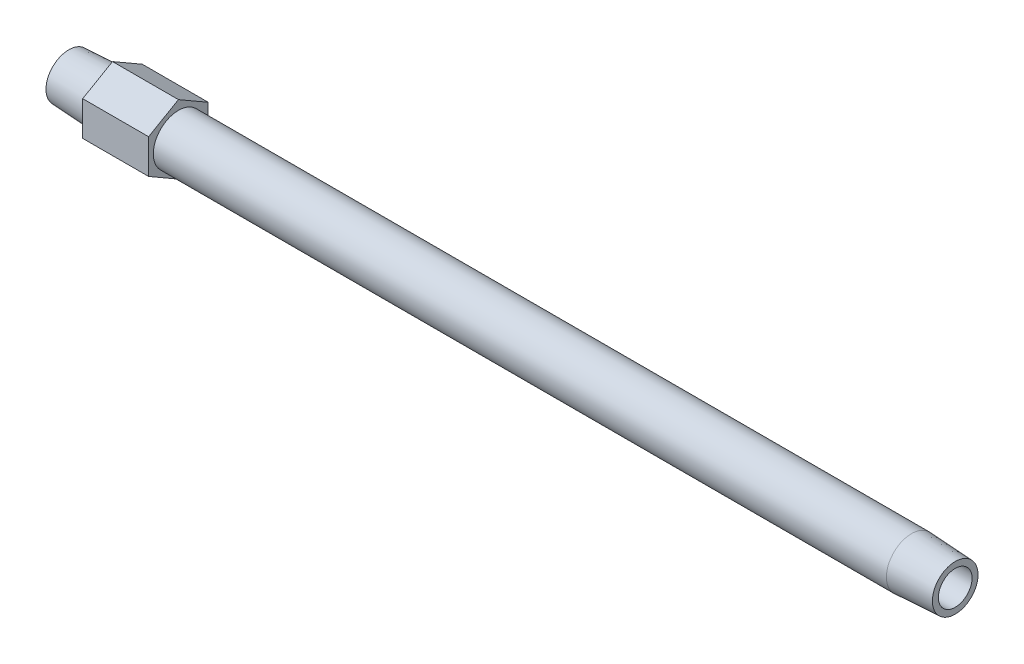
ISO-10303-21;
HEADER;
FILE_DESCRIPTION(('STEP AP214'),'2;1');
FILE_NAME('part.step','',(''),(''),'','','');
FILE_SCHEMA(('AUTOMOTIVE_DESIGN { 1 0 10303 214 1 1 1 1 }'));
ENDSEC;
DATA;
#1=APPLICATION_CONTEXT('core data for automotive mechanical design processes');
#2=APPLICATION_PROTOCOL_DEFINITION('international standard','automotive_design',2000,#1);
#3=PRODUCT_CONTEXT('',#1,'mechanical');
#4=PRODUCT('Part','Part','',(#3));
#5=PRODUCT_RELATED_PRODUCT_CATEGORY('part','',(#4));
#6=PRODUCT_DEFINITION_FORMATION('','',#4);
#7=PRODUCT_DEFINITION_CONTEXT('part definition',#1,'design');
#8=PRODUCT_DEFINITION('design','',#6,#7);
#9=PRODUCT_DEFINITION_SHAPE('','',#8);
#10=(LENGTH_UNIT() NAMED_UNIT(*) SI_UNIT(.MILLI.,.METRE.));
#11=(NAMED_UNIT(*) PLANE_ANGLE_UNIT() SI_UNIT($,.RADIAN.));
#12=(NAMED_UNIT(*) SI_UNIT($,.STERADIAN.) SOLID_ANGLE_UNIT());
#13=UNCERTAINTY_MEASURE_WITH_UNIT(LENGTH_MEASURE(1.E-05),#10,'distance_accuracy_value','');
#14=(GEOMETRIC_REPRESENTATION_CONTEXT(3) GLOBAL_UNCERTAINTY_ASSIGNED_CONTEXT((#13)) GLOBAL_UNIT_ASSIGNED_CONTEXT((#10,
#11,#12)) REPRESENTATION_CONTEXT('',''));
#15=CARTESIAN_POINT('',(0.,0.,0.));
#16=DIRECTION('',(0.,0.,1.));
#17=DIRECTION('',(1.,0.,0.));
#18=AXIS2_PLACEMENT_3D('',#15,#16,#17);
#19=CARTESIAN_POINT('',(0.,0.,-3.59899397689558));
#20=DIRECTION('',(1.,0.,0.));
#21=DIRECTION('',(0.,0.,-1.));
#22=AXIS2_PLACEMENT_3D('',#19,#20,#21);
#23=PLANE('',#22);
#24=CARTESIAN_POINT('',(0.,0.,0.));
#25=DIRECTION('',(-1.,0.,0.));
#26=DIRECTION('',(0.,0.,1.));
#27=AXIS2_PLACEMENT_3D('',#24,#25,#26);
#28=CIRCLE('',#27,3.59899397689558);
#29=CARTESIAN_POINT('',(0.,0.,3.59899397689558));
#30=VERTEX_POINT('',#29);
#31=EDGE_CURVE('E147',#30,#30,#28,.T.);
#32=ORIENTED_EDGE('',*,*,#31,.T.);
#33=EDGE_LOOP('',(#32));
#34=FACE_BOUND('',#33,.T.);
#35=CARTESIAN_POINT('',(0.,0.,0.));
#36=DIRECTION('',(1.,0.,0.));
#37=DIRECTION('',(0.,0.,1.));
#38=AXIS2_PLACEMENT_3D('',#35,#36,#37);
#39=CIRCLE('',#38,2.6543);
#40=CARTESIAN_POINT('',(0.,0.,2.6543));
#41=VERTEX_POINT('',#40);
#42=EDGE_CURVE('E159',#41,#41,#39,.T.);
#43=ORIENTED_EDGE('',*,*,#42,.T.);
#44=EDGE_LOOP('',(#43));
#45=FACE_BOUND('',#44,.T.);
#46=ADVANCED_FACE('F15',(#34,#45),#23,.F.);
#47=CARTESIAN_POINT('',(139.7,0.,-3.59899397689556));
#48=DIRECTION('',(-1.,0.,0.));
#49=DIRECTION('',(0.,0.,1.));
#50=AXIS2_PLACEMENT_3D('',#47,#48,#49);
#51=PLANE('',#50);
#52=CARTESIAN_POINT('',(139.7,0.,0.));
#53=DIRECTION('',(-1.,0.,0.));
#54=DIRECTION('',(0.,0.,1.));
#55=AXIS2_PLACEMENT_3D('',#52,#53,#54);
#56=CIRCLE('',#55,3.59899397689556);
#57=CARTESIAN_POINT('',(139.7,0.,3.59899397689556));
#58=VERTEX_POINT('',#57);
#59=EDGE_CURVE('E150',#58,#58,#56,.T.);
#60=ORIENTED_EDGE('',*,*,#59,.F.);
#61=EDGE_LOOP('',(#60));
#62=FACE_BOUND('',#61,.T.);
#63=CARTESIAN_POINT('',(139.7,0.,0.));
#64=DIRECTION('',(-1.,0.,0.));
#65=DIRECTION('',(0.,0.,1.));
#66=AXIS2_PLACEMENT_3D('',#63,#64,#65);
#67=CIRCLE('',#66,2.6543);
#68=CARTESIAN_POINT('',(139.7,0.,2.6543));
#69=VERTEX_POINT('',#68);
#70=EDGE_CURVE('E156',#69,#69,#67,.F.);
#71=ORIENTED_EDGE('',*,*,#70,.F.);
#72=EDGE_LOOP('',(#71));
#73=FACE_BOUND('',#72,.T.);
#74=ADVANCED_FACE('F178',(#62,#73),#51,.F.);
#75=CARTESIAN_POINT('',(17.272,-2.71296891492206,-4.699));
#76=DIRECTION('',(1.,0.,0.));
#77=DIRECTION('',(0.,1.,0.));
#78=AXIS2_PLACEMENT_3D('',#75,#76,#77);
#79=PLANE('',#78);
#80=DIRECTION('',(0.,0.5,-0.866025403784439));
#81=VECTOR('',#80,1.);
#82=CARTESIAN_POINT('',(17.272,-5.4259378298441,0.));
#83=LINE('',#82,#81);
#84=CARTESIAN_POINT('',(17.272,-5.4259378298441,0.));
#85=VERTEX_POINT('',#84);
#86=CARTESIAN_POINT('',(17.272,-2.71296891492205,-4.699));
#87=VERTEX_POINT('',#86);
#88=EDGE_CURVE('E103',#85,#87,#83,.T.);
#89=ORIENTED_EDGE('',*,*,#88,.T.);
#90=DIRECTION('',(0.,1.,0.));
#91=VECTOR('',#90,1.);
#92=CARTESIAN_POINT('',(17.272,-2.71296891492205,-4.699));
#93=LINE('',#92,#91);
#94=CARTESIAN_POINT('',(17.272,2.71296891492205,-4.699));
#95=VERTEX_POINT('',#94);
#96=EDGE_CURVE('E83',#87,#95,#93,.T.);
#97=ORIENTED_EDGE('',*,*,#96,.T.);
#98=DIRECTION('',(0.,0.5,0.866025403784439));
#99=VECTOR('',#98,1.);
#100=CARTESIAN_POINT('',(17.272,2.71296891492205,-4.699));
#101=LINE('',#100,#99);
#102=CARTESIAN_POINT('',(17.272,5.4259378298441,0.));
#103=VERTEX_POINT('',#102);
#104=EDGE_CURVE('E102',#95,#103,#101,.T.);
#105=ORIENTED_EDGE('',*,*,#104,.T.);
#106=DIRECTION('',(0.,-0.5,0.866025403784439));
#107=VECTOR('',#106,1.);
#108=CARTESIAN_POINT('',(17.272,5.4259378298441,0.));
#109=LINE('',#108,#107);
#110=CARTESIAN_POINT('',(17.272,2.71296891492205,4.699));
#111=VERTEX_POINT('',#110);
#112=EDGE_CURVE('E105',#103,#111,#109,.T.);
#113=ORIENTED_EDGE('',*,*,#112,.T.);
#114=DIRECTION('',(0.,-1.,0.));
#115=VECTOR('',#114,1.);
#116=CARTESIAN_POINT('',(17.272,2.71296891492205,4.699));
#117=LINE('',#116,#115);
#118=CARTESIAN_POINT('',(17.272,-2.71296891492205,4.699));
#119=VERTEX_POINT('',#118);
#120=EDGE_CURVE('E35',#111,#119,#117,.T.);
#121=ORIENTED_EDGE('',*,*,#120,.T.);
#122=DIRECTION('',(0.,-0.5,-0.866025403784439));
#123=VECTOR('',#122,1.);
#124=CARTESIAN_POINT('',(17.272,-2.71296891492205,4.699));
#125=LINE('',#124,#123);
#126=EDGE_CURVE('E30',#119,#85,#125,.T.);
#127=ORIENTED_EDGE('',*,*,#126,.T.);
#128=EDGE_LOOP('',(#89,#97,#105,#113,#121,#127));
#129=FACE_BOUND('',#128,.T.);
#130=CARTESIAN_POINT('',(17.272,0.,0.));
#131=DIRECTION('',(1.,0.,0.));
#132=DIRECTION('',(0.,1.,0.));
#133=AXIS2_PLACEMENT_3D('',#130,#131,#132);
#134=CIRCLE('',#133,3.95973768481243);
#135=CARTESIAN_POINT('',(17.272,3.95973768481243,0.));
#136=VERTEX_POINT('',#135);
#137=EDGE_CURVE('E89',#136,#136,#134,.F.);
#138=ORIENTED_EDGE('',*,*,#137,.T.);
#139=EDGE_LOOP('',(#138));
#140=FACE_BOUND('',#139,.T.);
#141=ADVANCED_FACE('F124',(#129,#140),#79,.T.);
#142=CARTESIAN_POINT('',(6.8834,-2.71296891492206,-4.699));
#143=DIRECTION('',(1.,0.,0.));
#144=DIRECTION('',(0.,1.,0.));
#145=AXIS2_PLACEMENT_3D('',#142,#143,#144);
#146=PLANE('',#145);
#147=DIRECTION('',(0.,0.5,-0.866025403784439));
#148=VECTOR('',#147,1.);
#149=CARTESIAN_POINT('',(6.8834,-5.4259378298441,0.));
#150=LINE('',#149,#148);
#151=CARTESIAN_POINT('',(6.8834,-5.4259378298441,0.));
#152=VERTEX_POINT('',#151);
#153=CARTESIAN_POINT('',(6.8834,-2.71296891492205,-4.699));
#154=VERTEX_POINT('',#153);
#155=EDGE_CURVE('E73',#152,#154,#150,.T.);
#156=ORIENTED_EDGE('',*,*,#155,.F.);
#157=DIRECTION('',(0.,-0.5,-0.866025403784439));
#158=VECTOR('',#157,1.);
#159=CARTESIAN_POINT('',(6.8834,-2.71296891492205,4.699));
#160=LINE('',#159,#158);
#161=CARTESIAN_POINT('',(6.8834,-2.71296891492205,4.699));
#162=VERTEX_POINT('',#161);
#163=EDGE_CURVE('E99',#162,#152,#160,.T.);
#164=ORIENTED_EDGE('',*,*,#163,.F.);
#165=DIRECTION('',(0.,-1.,0.));
#166=VECTOR('',#165,1.);
#167=CARTESIAN_POINT('',(6.8834,2.71296891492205,4.699));
#168=LINE('',#167,#166);
#169=CARTESIAN_POINT('',(6.8834,2.71296891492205,4.699));
#170=VERTEX_POINT('',#169);
#171=EDGE_CURVE('E133',#170,#162,#168,.T.);
#172=ORIENTED_EDGE('',*,*,#171,.F.);
#173=DIRECTION('',(0.,-0.5,0.866025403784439));
#174=VECTOR('',#173,1.);
#175=CARTESIAN_POINT('',(6.8834,5.4259378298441,0.));
#176=LINE('',#175,#174);
#177=CARTESIAN_POINT('',(6.8834,5.4259378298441,0.));
#178=VERTEX_POINT('',#177);
#179=EDGE_CURVE('E129',#178,#170,#176,.T.);
#180=ORIENTED_EDGE('',*,*,#179,.F.);
#181=DIRECTION('',(0.,0.5,0.866025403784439));
#182=VECTOR('',#181,1.);
#183=CARTESIAN_POINT('',(6.8834,2.71296891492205,-4.699));
#184=LINE('',#183,#182);
#185=CARTESIAN_POINT('',(6.8834,2.71296891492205,-4.699));
#186=VERTEX_POINT('',#185);
#187=EDGE_CURVE('E75',#186,#178,#184,.T.);
#188=ORIENTED_EDGE('',*,*,#187,.F.);
#189=DIRECTION('',(0.,1.,0.));
#190=VECTOR('',#189,1.);
#191=CARTESIAN_POINT('',(6.8834,-2.71296891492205,-4.699));
#192=LINE('',#191,#190);
#193=EDGE_CURVE('E68',#154,#186,#192,.T.);
#194=ORIENTED_EDGE('',*,*,#193,.F.);
#195=EDGE_LOOP('',(#156,#164,#172,#180,#188,#194));
#196=FACE_BOUND('',#195,.T.);
#197=CARTESIAN_POINT('',(6.8834,0.,0.));
#198=DIRECTION('',(-1.,0.,0.));
#199=DIRECTION('',(0.,0.,1.));
#200=AXIS2_PLACEMENT_3D('',#197,#198,#199);
#201=CIRCLE('',#200,3.95973768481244);
#202=CARTESIAN_POINT('',(6.8834,0.,3.95973768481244));
#203=VERTEX_POINT('',#202);
#204=EDGE_CURVE('E95',#203,#203,#201,.T.);
#205=ORIENTED_EDGE('',*,*,#204,.F.);
#206=EDGE_LOOP('',(#205));
#207=FACE_BOUND('',#206,.T.);
#208=ADVANCED_FACE('F69',(#196,#207),#146,.F.);
#209=CARTESIAN_POINT('',(17.272,-5.4259378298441,0.));
#210=DIRECTION('',(0.,0.866025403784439,0.5));
#211=DIRECTION('',(0.,-0.5,0.866025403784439));
#212=AXIS2_PLACEMENT_3D('',#209,#210,#211);
#213=PLANE('',#212);
#214=ORIENTED_EDGE('',*,*,#155,.T.);
#215=DIRECTION('',(-1.,0.,0.));
#216=VECTOR('',#215,1.);
#217=CARTESIAN_POINT('',(17.272,-2.71296891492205,-4.699));
#218=LINE('',#217,#216);
#219=EDGE_CURVE('E10',#87,#154,#218,.T.);
#220=ORIENTED_EDGE('',*,*,#219,.F.);
#221=ORIENTED_EDGE('',*,*,#88,.F.);
#222=DIRECTION('',(-1.,0.,0.));
#223=VECTOR('',#222,1.);
#224=CARTESIAN_POINT('',(17.272,-5.4259378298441,0.));
#225=LINE('',#224,#223);
#226=EDGE_CURVE('E87',#85,#152,#225,.T.);
#227=ORIENTED_EDGE('',*,*,#226,.T.);
#228=EDGE_LOOP('',(#214,#220,#221,#227));
#229=FACE_BOUND('',#228,.T.);
#230=ADVANCED_FACE('F17',(#229),#213,.F.);
#231=CARTESIAN_POINT('',(17.272,-2.71296891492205,-4.699));
#232=DIRECTION('',(0.,0.,1.));
#233=DIRECTION('',(1.,0.,0.));
#234=AXIS2_PLACEMENT_3D('',#231,#232,#233);
#235=PLANE('',#234);
#236=ORIENTED_EDGE('',*,*,#193,.T.);
#237=DIRECTION('',(-1.,0.,0.));
#238=VECTOR('',#237,1.);
#239=CARTESIAN_POINT('',(17.272,2.71296891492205,-4.699));
#240=LINE('',#239,#238);
#241=EDGE_CURVE('E23',#95,#186,#240,.T.);
#242=ORIENTED_EDGE('',*,*,#241,.F.);
#243=ORIENTED_EDGE('',*,*,#96,.F.);
#244=ORIENTED_EDGE('',*,*,#219,.T.);
#245=EDGE_LOOP('',(#236,#242,#243,#244));
#246=FACE_BOUND('',#245,.T.);
#247=ADVANCED_FACE('F82',(#246),#235,.F.);
#248=CARTESIAN_POINT('',(17.272,2.71296891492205,-4.699));
#249=DIRECTION('',(0.,-0.866025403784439,0.5));
#250=DIRECTION('',(0.,-0.5,-0.866025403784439));
#251=AXIS2_PLACEMENT_3D('',#248,#249,#250);
#252=PLANE('',#251);
#253=ORIENTED_EDGE('',*,*,#187,.T.);
#254=DIRECTION('',(-1.,0.,0.));
#255=VECTOR('',#254,1.);
#256=CARTESIAN_POINT('',(17.272,5.4259378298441,0.));
#257=LINE('',#256,#255);
#258=EDGE_CURVE('E117',#103,#178,#257,.T.);
#259=ORIENTED_EDGE('',*,*,#258,.F.);
#260=ORIENTED_EDGE('',*,*,#104,.F.);
#261=ORIENTED_EDGE('',*,*,#241,.T.);
#262=EDGE_LOOP('',(#253,#259,#260,#261));
#263=FACE_BOUND('',#262,.T.);
#264=ADVANCED_FACE('F121',(#263),#252,.F.);
#265=CARTESIAN_POINT('',(17.272,5.4259378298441,0.));
#266=DIRECTION('',(0.,-0.866025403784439,-0.5));
#267=DIRECTION('',(0.,0.5,-0.866025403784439));
#268=AXIS2_PLACEMENT_3D('',#265,#266,#267);
#269=PLANE('',#268);
#270=ORIENTED_EDGE('',*,*,#179,.T.);
#271=DIRECTION('',(-1.,0.,0.));
#272=VECTOR('',#271,1.);
#273=CARTESIAN_POINT('',(17.272,2.71296891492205,4.699));
#274=LINE('',#273,#272);
#275=EDGE_CURVE('E114',#111,#170,#274,.T.);
#276=ORIENTED_EDGE('',*,*,#275,.F.);
#277=ORIENTED_EDGE('',*,*,#112,.F.);
#278=ORIENTED_EDGE('',*,*,#258,.T.);
#279=EDGE_LOOP('',(#270,#276,#277,#278));
#280=FACE_BOUND('',#279,.T.);
#281=ADVANCED_FACE('F128',(#280),#269,.F.);
#282=CARTESIAN_POINT('',(17.272,2.71296891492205,4.699));
#283=DIRECTION('',(0.,0.,-1.));
#284=DIRECTION('',(-1.,0.,0.));
#285=AXIS2_PLACEMENT_3D('',#282,#283,#284);
#286=PLANE('',#285);
#287=ORIENTED_EDGE('',*,*,#171,.T.);
#288=DIRECTION('',(-1.,0.,0.));
#289=VECTOR('',#288,1.);
#290=CARTESIAN_POINT('',(17.272,-2.71296891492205,4.699));
#291=LINE('',#290,#289);
#292=EDGE_CURVE('E111',#119,#162,#291,.T.);
#293=ORIENTED_EDGE('',*,*,#292,.F.);
#294=ORIENTED_EDGE('',*,*,#120,.F.);
#295=ORIENTED_EDGE('',*,*,#275,.T.);
#296=EDGE_LOOP('',(#287,#293,#294,#295));
#297=FACE_BOUND('',#296,.T.);
#298=ADVANCED_FACE('F132',(#297),#286,.F.);
#299=CARTESIAN_POINT('',(17.272,-2.71296891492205,4.699));
#300=DIRECTION('',(0.,0.866025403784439,-0.5));
#301=DIRECTION('',(0.,0.5,0.866025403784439));
#302=AXIS2_PLACEMENT_3D('',#299,#300,#301);
#303=PLANE('',#302);
#304=ORIENTED_EDGE('',*,*,#163,.T.);
#305=ORIENTED_EDGE('',*,*,#226,.F.);
#306=ORIENTED_EDGE('',*,*,#126,.F.);
#307=ORIENTED_EDGE('',*,*,#292,.T.);
#308=EDGE_LOOP('',(#304,#305,#306,#307));
#309=FACE_BOUND('',#308,.T.);
#310=ADVANCED_FACE('F135',(#309),#303,.F.);
#311=CARTESIAN_POINT('',(6.8834,0.,0.));
#312=DIRECTION('',(1.,0.,0.));
#313=DIRECTION('',(0.,0.,-1.));
#314=AXIS2_PLACEMENT_3D('',#311,#312,#313);
#315=CONICAL_SURFACE('',#314,3.95973768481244,0.0523598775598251);
#316=ORIENTED_EDGE('',*,*,#31,.F.);
#317=EDGE_LOOP('',(#316));
#318=FACE_BOUND('',#317,.T.);
#319=ORIENTED_EDGE('',*,*,#204,.T.);
#320=EDGE_LOOP('',(#319));
#321=FACE_BOUND('',#320,.T.);
#322=ADVANCED_FACE('F187',(#318,#321),#315,.T.);
#323=CARTESIAN_POINT('',(-60.,0.,0.));
#324=DIRECTION('',(-1.,0.,0.));
#325=DIRECTION('',(0.,0.,1.));
#326=AXIS2_PLACEMENT_3D('',#323,#324,#325);
#327=CYLINDRICAL_SURFACE('',#326,3.95973768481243);
#328=ORIENTED_EDGE('',*,*,#137,.F.);
#329=EDGE_LOOP('',(#328));
#330=FACE_BOUND('',#329,.T.);
#331=CARTESIAN_POINT('',(132.8166,0.,0.));
#332=DIRECTION('',(-1.,0.,0.));
#333=DIRECTION('',(0.,0.,1.));
#334=AXIS2_PLACEMENT_3D('',#331,#332,#333);
#335=CIRCLE('',#334,3.95973768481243);
#336=CARTESIAN_POINT('',(132.8166,0.,3.95973768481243));
#337=VERTEX_POINT('',#336);
#338=EDGE_CURVE('E153',#337,#337,#335,.T.);
#339=ORIENTED_EDGE('',*,*,#338,.T.);
#340=EDGE_LOOP('',(#339));
#341=FACE_BOUND('',#340,.T.);
#342=ADVANCED_FACE('F174',(#330,#341),#327,.T.);
#343=CARTESIAN_POINT('',(139.7,0.,0.));
#344=DIRECTION('',(-1.,0.,0.));
#345=DIRECTION('',(0.,0.,1.));
#346=AXIS2_PLACEMENT_3D('',#343,#344,#345);
#347=CONICAL_SURFACE('',#346,3.59899397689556,0.0523598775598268);
#348=ORIENTED_EDGE('',*,*,#338,.F.);
#349=EDGE_LOOP('',(#348));
#350=FACE_BOUND('',#349,.T.);
#351=ORIENTED_EDGE('',*,*,#59,.T.);
#352=EDGE_LOOP('',(#351));
#353=FACE_BOUND('',#352,.T.);
#354=ADVANCED_FACE('F167',(#350,#353),#347,.T.);
#355=CARTESIAN_POINT('',(140.435663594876,0.,0.));
#356=DIRECTION('',(-1.,0.,0.));
#357=DIRECTION('',(0.,0.,1.));
#358=AXIS2_PLACEMENT_3D('',#355,#356,#357);
#359=CYLINDRICAL_SURFACE('',#358,2.6543);
#360=ORIENTED_EDGE('',*,*,#70,.T.);
#361=EDGE_LOOP('',(#360));
#362=FACE_BOUND('',#361,.T.);
#363=ORIENTED_EDGE('',*,*,#42,.F.);
#364=EDGE_LOOP('',(#363));
#365=FACE_BOUND('',#364,.T.);
#366=ADVANCED_FACE('F165',(#362,#365),#359,.F.);
#367=CLOSED_SHELL('',(#46,#74,#141,#208,#230,#247,#264,#281,#298,#310,#322,#342,#354,#366));
#368=MANIFOLD_SOLID_BREP('B1',#367);
#369=ADVANCED_BREP_SHAPE_REPRESENTATION('',(#18,#368),#14);
#370=SHAPE_DEFINITION_REPRESENTATION(#9,#369);
ENDSEC;
END-ISO-10303-21;
